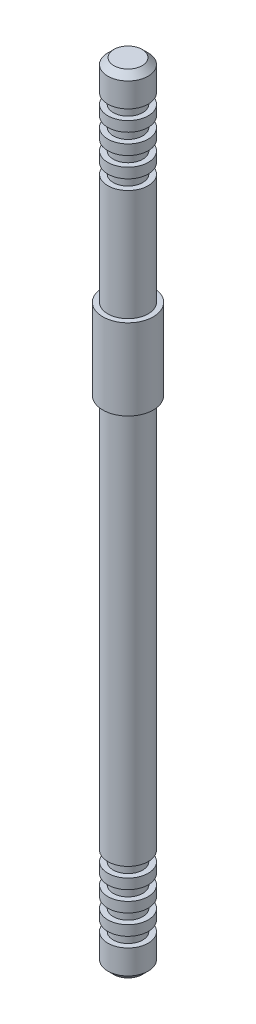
from build123d import *

# Parameters (mm, degrees)
CHANFREIN1_SIZE = 0.3


with BuildPart() as part:
    # Esquisse1 → R_volution1 (revolve)
    with BuildSketch(Plane.XY, mode=Mode.PRIVATE) as r_volution1_sk:
        Polygon((-26.372575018, -54.790002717), (-26.372575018, -56.290002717), (-26.102575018, -56.290002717), (-26.102575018, -56.790002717), (-26.372575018, -56.790002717), (-26.372575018, -57.290002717), (-26.102575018, -57.290002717), (-26.102575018, -57.790002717), (-26.372575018, -57.790002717), (-26.372575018, -58.290002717), (-26.102575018, -58.290002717), (-26.102575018, -58.790002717), (-26.372575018, -58.790002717), (-26.372575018, -59.290002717), (-26.102575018, -59.290002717), (-26.102575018, -59.790002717), (-26.372575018, -59.790002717), (-26.372575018, -65.290002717), (-26.622575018, -65.290002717), (-26.622575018, -69.290002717), (-26.372575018, -69.290002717), (-26.372575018, -88.790002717), (-26.102575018, -88.790002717), (-26.102575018, -89.290002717), (-26.372575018, -89.290002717), (-26.372575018, -89.790002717), (-26.102575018, -89.790002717), (-26.102575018, -90.290002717), (-26.372575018, -90.290002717), (-26.372575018, -90.790002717), (-26.102575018, -90.790002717), (-26.102575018, -91.290002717), (-26.372575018, -91.290002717), (-26.372575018, -91.790002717), (-26.102575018, -91.790002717), (-26.102575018, -92.290002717), (-26.372575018, -92.290002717), (-26.372575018, -93.790002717), (-25.372575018, -93.790002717), (-25.372575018, -54.790002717), align=None)
    revolve(r_volution1_sk.sketch.rotate(Axis((-25.372575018, -54.790002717, 0), (0, 1, 0)), 270), axis=Axis((-25.372575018, -54.790002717, 0), (0, 1, 0)))

    # Chanfrein1
    chanfrein1_edges = [part.edges().sort_by_distance(p)[0] for p in [
        (-25.372575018, -93.790002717, 1),
        (-25.372575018, -54.790002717, 1),
    ]]
    chamfer(chanfrein1_edges, length=CHANFREIN1_SIZE)


solid = part.part
